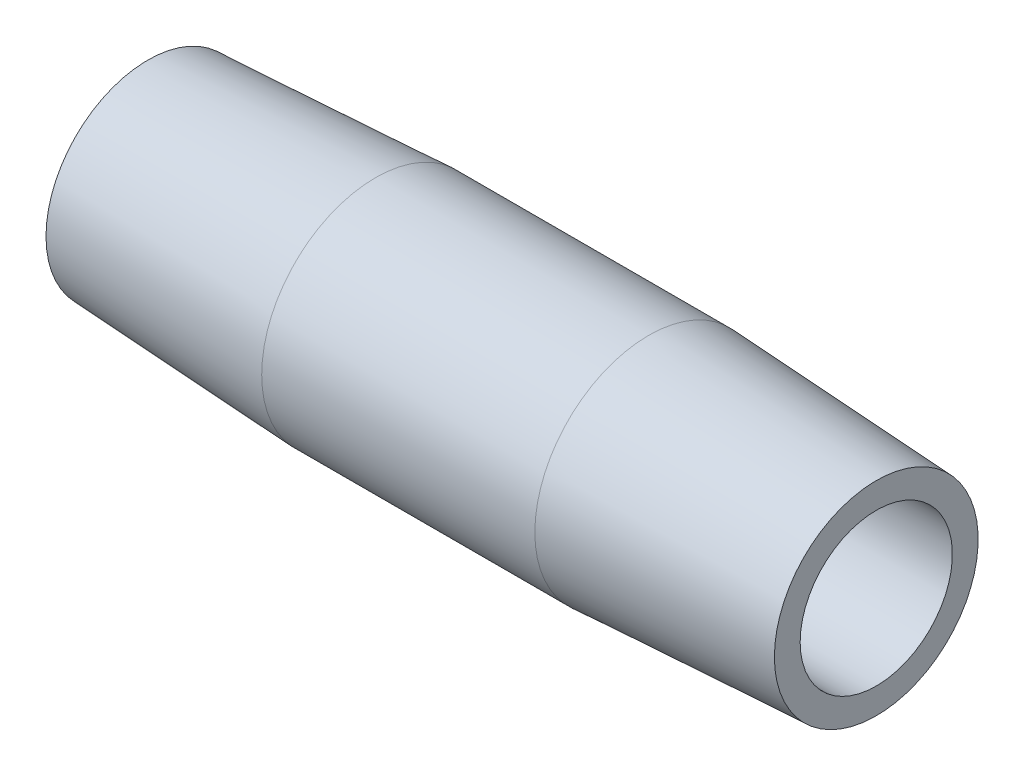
ISO-10303-21;
HEADER;
FILE_DESCRIPTION(('STEP AP214'),'2;1');
FILE_NAME('part.step','',(''),(''),'','','');
FILE_SCHEMA(('AUTOMOTIVE_DESIGN { 1 0 10303 214 1 1 1 1 }'));
ENDSEC;
DATA;
#1=APPLICATION_CONTEXT('core data for automotive mechanical design processes');
#2=APPLICATION_PROTOCOL_DEFINITION('international standard','automotive_design',2000,#1);
#3=PRODUCT_CONTEXT('',#1,'mechanical');
#4=PRODUCT('Part','Part','',(#3));
#5=PRODUCT_RELATED_PRODUCT_CATEGORY('part','',(#4));
#6=PRODUCT_DEFINITION_FORMATION('','',#4);
#7=PRODUCT_DEFINITION_CONTEXT('part definition',#1,'design');
#8=PRODUCT_DEFINITION('design','',#6,#7);
#9=PRODUCT_DEFINITION_SHAPE('','',#8);
#10=(LENGTH_UNIT() NAMED_UNIT(*) SI_UNIT(.MILLI.,.METRE.));
#11=(NAMED_UNIT(*) PLANE_ANGLE_UNIT() SI_UNIT($,.RADIAN.));
#12=(NAMED_UNIT(*) SI_UNIT($,.STERADIAN.) SOLID_ANGLE_UNIT());
#13=UNCERTAINTY_MEASURE_WITH_UNIT(LENGTH_MEASURE(1.E-05),#10,'distance_accuracy_value','');
#14=(GEOMETRIC_REPRESENTATION_CONTEXT(3) GLOBAL_UNCERTAINTY_ASSIGNED_CONTEXT((#13)) GLOBAL_UNIT_ASSIGNED_CONTEXT((#10,
#11,#12)) REPRESENTATION_CONTEXT('',''));
#15=CARTESIAN_POINT('',(0.,0.,0.));
#16=DIRECTION('',(0.,0.,1.));
#17=DIRECTION('',(1.,0.,0.));
#18=AXIS2_PLACEMENT_3D('',#15,#16,#17);
#19=CARTESIAN_POINT('',(0.476141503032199,0.,0.));
#20=DIRECTION('',(-1.,0.,0.));
#21=DIRECTION('',(0.,0.,1.));
#22=AXIS2_PLACEMENT_3D('',#19,#20,#21);
#23=CYLINDRICAL_SURFACE('',#22,3.96875);
#24=CARTESIAN_POINT('',(7.9375,0.,0.));
#25=DIRECTION('',(-1.,0.,0.));
#26=DIRECTION('',(0.,0.,1.));
#27=AXIS2_PLACEMENT_3D('',#24,#25,#26);
#28=CIRCLE('',#27,3.96875);
#29=CARTESIAN_POINT('',(7.9375,0.,3.96875));
#30=VERTEX_POINT('',#29);
#31=EDGE_CURVE('E10',#30,#30,#28,.T.);
#32=ORIENTED_EDGE('',*,*,#31,.F.);
#33=EDGE_LOOP('',(#32));
#34=FACE_BOUND('',#33,.T.);
#35=CARTESIAN_POINT('',(17.4625,0.,0.));
#36=DIRECTION('',(-1.,0.,0.));
#37=DIRECTION('',(0.,0.,1.));
#38=AXIS2_PLACEMENT_3D('',#35,#36,#37);
#39=CIRCLE('',#38,3.96875);
#40=CARTESIAN_POINT('',(17.4625,0.,3.96875));
#41=VERTEX_POINT('',#40);
#42=EDGE_CURVE('E52',#41,#41,#39,.T.);
#43=ORIENTED_EDGE('',*,*,#42,.T.);
#44=EDGE_LOOP('',(#43));
#45=FACE_BOUND('',#44,.T.);
#46=ADVANCED_FACE('F30',(#34,#45),#23,.T.);
#47=CARTESIAN_POINT('',(7.9375,0.,0.));
#48=DIRECTION('',(1.,0.,0.));
#49=DIRECTION('',(0.,0.,-1.));
#50=AXIS2_PLACEMENT_3D('',#47,#48,#49);
#51=CONICAL_SURFACE('',#50,3.96875,0.0523598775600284);
#52=CARTESIAN_POINT('',(0.,0.,0.));
#53=DIRECTION('',(-1.,0.,0.));
#54=DIRECTION('',(0.,0.,1.));
#55=AXIS2_PLACEMENT_3D('',#52,#53,#54);
#56=CIRCLE('',#55,3.55276325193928);
#57=CARTESIAN_POINT('',(0.,0.,3.55276325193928));
#58=VERTEX_POINT('',#57);
#59=EDGE_CURVE('E36',#58,#58,#56,.T.);
#60=ORIENTED_EDGE('',*,*,#59,.F.);
#61=EDGE_LOOP('',(#60));
#62=FACE_BOUND('',#61,.T.);
#63=ORIENTED_EDGE('',*,*,#31,.T.);
#64=EDGE_LOOP('',(#63));
#65=FACE_BOUND('',#64,.T.);
#66=ADVANCED_FACE('F77',(#62,#65),#51,.T.);
#67=CARTESIAN_POINT('',(0.,3.55276325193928,0.));
#68=DIRECTION('',(1.,0.,0.));
#69=DIRECTION('',(0.,0.,-1.));
#70=AXIS2_PLACEMENT_3D('',#67,#68,#69);
#71=PLANE('',#70);
#72=CARTESIAN_POINT('',(0.,0.,0.));
#73=DIRECTION('',(-1.,0.,0.));
#74=DIRECTION('',(0.,0.,1.));
#75=AXIS2_PLACEMENT_3D('',#72,#73,#74);
#76=CIRCLE('',#75,2.65429999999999);
#77=CARTESIAN_POINT('',(0.,0.,2.65429999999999));
#78=VERTEX_POINT('',#77);
#79=EDGE_CURVE('E40',#78,#78,#76,.T.);
#80=ORIENTED_EDGE('',*,*,#79,.F.);
#81=EDGE_LOOP('',(#80));
#82=FACE_BOUND('',#81,.T.);
#83=ORIENTED_EDGE('',*,*,#59,.T.);
#84=EDGE_LOOP('',(#83));
#85=FACE_BOUND('',#84,.T.);
#86=ADVANCED_FACE('F72',(#82,#85),#71,.F.);
#87=CARTESIAN_POINT('',(0.476141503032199,0.,0.));
#88=DIRECTION('',(-1.,0.,0.));
#89=DIRECTION('',(0.,0.,1.));
#90=AXIS2_PLACEMENT_3D('',#87,#88,#89);
#91=CYLINDRICAL_SURFACE('',#90,2.6543);
#92=CARTESIAN_POINT('',(25.4,0.,0.));
#93=DIRECTION('',(-1.,0.,0.));
#94=DIRECTION('',(0.,0.,1.));
#95=AXIS2_PLACEMENT_3D('',#92,#93,#94);
#96=CIRCLE('',#95,2.6543);
#97=CARTESIAN_POINT('',(25.4,0.,2.6543));
#98=VERTEX_POINT('',#97);
#99=EDGE_CURVE('E44',#98,#98,#96,.T.);
#100=ORIENTED_EDGE('',*,*,#99,.F.);
#101=EDGE_LOOP('',(#100));
#102=FACE_BOUND('',#101,.T.);
#103=ORIENTED_EDGE('',*,*,#79,.T.);
#104=EDGE_LOOP('',(#103));
#105=FACE_BOUND('',#104,.T.);
#106=ADVANCED_FACE('F66',(#102,#105),#91,.F.);
#107=CARTESIAN_POINT('',(25.4,2.6543,0.));
#108=DIRECTION('',(-1.,0.,0.));
#109=DIRECTION('',(0.,0.,1.));
#110=AXIS2_PLACEMENT_3D('',#107,#108,#109);
#111=PLANE('',#110);
#112=CARTESIAN_POINT('',(25.4,0.,0.));
#113=DIRECTION('',(-1.,0.,0.));
#114=DIRECTION('',(0.,0.,1.));
#115=AXIS2_PLACEMENT_3D('',#112,#113,#114);
#116=CIRCLE('',#115,3.55276325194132);
#117=CARTESIAN_POINT('',(25.4,0.,3.55276325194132));
#118=VERTEX_POINT('',#117);
#119=EDGE_CURVE('E49',#118,#118,#116,.T.);
#120=ORIENTED_EDGE('',*,*,#119,.F.);
#121=EDGE_LOOP('',(#120));
#122=FACE_BOUND('',#121,.T.);
#123=ORIENTED_EDGE('',*,*,#99,.T.);
#124=EDGE_LOOP('',(#123));
#125=FACE_BOUND('',#124,.T.);
#126=ADVANCED_FACE('F60',(#122,#125),#111,.F.);
#127=CARTESIAN_POINT('',(25.4,0.,0.));
#128=DIRECTION('',(-1.,0.,0.));
#129=DIRECTION('',(0.,0.,1.));
#130=AXIS2_PLACEMENT_3D('',#127,#128,#129);
#131=CONICAL_SURFACE('',#130,3.55276325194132,0.0523598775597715);
#132=ORIENTED_EDGE('',*,*,#42,.F.);
#133=EDGE_LOOP('',(#132));
#134=FACE_BOUND('',#133,.T.);
#135=ORIENTED_EDGE('',*,*,#119,.T.);
#136=EDGE_LOOP('',(#135));
#137=FACE_BOUND('',#136,.T.);
#138=ADVANCED_FACE('F57',(#134,#137),#131,.T.);
#139=CLOSED_SHELL('',(#46,#66,#86,#106,#126,#138));
#140=MANIFOLD_SOLID_BREP('B2',#139);
#141=ADVANCED_BREP_SHAPE_REPRESENTATION('',(#18,#140),#14);
#142=SHAPE_DEFINITION_REPRESENTATION(#9,#141);
ENDSEC;
END-ISO-10303-21;
